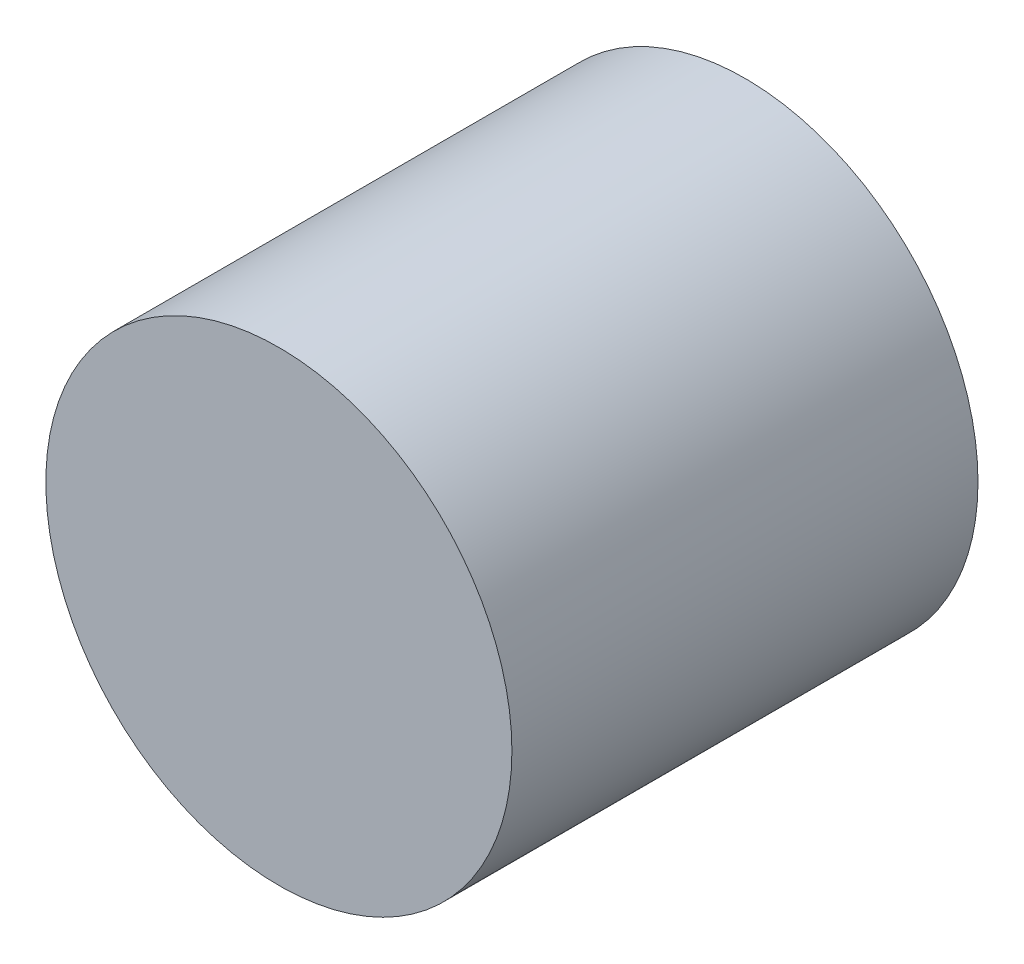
ISO-10303-21;
HEADER;
FILE_DESCRIPTION(('STEP AP214'),'2;1');
FILE_NAME('part.step','',(''),(''),'','','');
FILE_SCHEMA(('AUTOMOTIVE_DESIGN { 1 0 10303 214 1 1 1 1 }'));
ENDSEC;
DATA;
#1=APPLICATION_CONTEXT('core data for automotive mechanical design processes');
#2=APPLICATION_PROTOCOL_DEFINITION('international standard','automotive_design',2000,#1);
#3=PRODUCT_CONTEXT('',#1,'mechanical');
#4=PRODUCT('Part','Part','',(#3));
#5=PRODUCT_RELATED_PRODUCT_CATEGORY('part','',(#4));
#6=PRODUCT_DEFINITION_FORMATION('','',#4);
#7=PRODUCT_DEFINITION_CONTEXT('part definition',#1,'design');
#8=PRODUCT_DEFINITION('design','',#6,#7);
#9=PRODUCT_DEFINITION_SHAPE('','',#8);
#10=(LENGTH_UNIT() NAMED_UNIT(*) SI_UNIT(.MILLI.,.METRE.));
#11=(NAMED_UNIT(*) PLANE_ANGLE_UNIT() SI_UNIT($,.RADIAN.));
#12=(NAMED_UNIT(*) SI_UNIT($,.STERADIAN.) SOLID_ANGLE_UNIT());
#13=UNCERTAINTY_MEASURE_WITH_UNIT(LENGTH_MEASURE(1.E-05),#10,'distance_accuracy_value','');
#14=(GEOMETRIC_REPRESENTATION_CONTEXT(3) GLOBAL_UNCERTAINTY_ASSIGNED_CONTEXT((#13)) GLOBAL_UNIT_ASSIGNED_CONTEXT((#10,
#11,#12)) REPRESENTATION_CONTEXT('',''));
#15=CARTESIAN_POINT('',(0.,0.,0.));
#16=DIRECTION('',(0.,0.,1.));
#17=DIRECTION('',(1.,0.,0.));
#18=AXIS2_PLACEMENT_3D('',#15,#16,#17);
#19=CARTESIAN_POINT('',(0.,0.,30.));
#20=DIRECTION('',(0.,0.,1.));
#21=DIRECTION('',(1.,0.,0.));
#22=AXIS2_PLACEMENT_3D('',#19,#20,#21);
#23=CYLINDRICAL_SURFACE('',#22,5.);
#24=CARTESIAN_POINT('',(0.,0.,10.));
#25=DIRECTION('',(0.,0.,1.));
#26=DIRECTION('',(1.,0.,0.));
#27=AXIS2_PLACEMENT_3D('',#24,#25,#26);
#28=CIRCLE('',#27,5.);
#29=CARTESIAN_POINT('',(5.,0.,10.));
#30=VERTEX_POINT('',#29);
#31=EDGE_CURVE('E27',#30,#30,#28,.T.);
#32=ORIENTED_EDGE('',*,*,#31,.F.);
#33=EDGE_LOOP('',(#32));
#34=FACE_BOUND('',#33,.T.);
#35=CARTESIAN_POINT('',(0.,0.,0.));
#36=DIRECTION('',(0.,0.,1.));
#37=DIRECTION('',(1.,0.,0.));
#38=AXIS2_PLACEMENT_3D('',#35,#36,#37);
#39=CIRCLE('',#38,5.);
#40=CARTESIAN_POINT('',(5.,0.,0.));
#41=VERTEX_POINT('',#40);
#42=EDGE_CURVE('E8',#41,#41,#39,.T.);
#43=ORIENTED_EDGE('',*,*,#42,.T.);
#44=EDGE_LOOP('',(#43));
#45=FACE_BOUND('',#44,.T.);
#46=ADVANCED_FACE('F13',(#34,#45),#23,.T.);
#47=CARTESIAN_POINT('',(2.5,0.,0.));
#48=DIRECTION('',(0.,0.,1.));
#49=DIRECTION('',(1.,0.,0.));
#50=AXIS2_PLACEMENT_3D('',#47,#48,#49);
#51=PLANE('',#50);
#52=ORIENTED_EDGE('',*,*,#42,.F.);
#53=EDGE_LOOP('',(#52));
#54=FACE_BOUND('',#53,.T.);
#55=CARTESIAN_POINT('',(0.,0.,0.));
#56=DIRECTION('',(0.,0.,1.));
#57=DIRECTION('',(1.,0.,0.));
#58=AXIS2_PLACEMENT_3D('',#55,#56,#57);
#59=CIRCLE('',#58,2.5);
#60=CARTESIAN_POINT('',(2.5,0.,0.));
#61=VERTEX_POINT('',#60);
#62=EDGE_CURVE('E19',#61,#61,#59,.T.);
#63=ORIENTED_EDGE('',*,*,#62,.T.);
#64=EDGE_LOOP('',(#63));
#65=FACE_BOUND('',#64,.T.);
#66=ADVANCED_FACE('F36',(#54,#65),#51,.F.);
#67=CARTESIAN_POINT('',(0.,0.,30.));
#68=DIRECTION('',(0.,0.,1.));
#69=DIRECTION('',(1.,0.,0.));
#70=AXIS2_PLACEMENT_3D('',#67,#68,#69);
#71=CYLINDRICAL_SURFACE('',#70,2.5);
#72=ORIENTED_EDGE('',*,*,#62,.F.);
#73=EDGE_LOOP('',(#72));
#74=FACE_BOUND('',#73,.T.);
#75=CARTESIAN_POINT('',(0.,0.,5.));
#76=DIRECTION('',(0.,0.,1.));
#77=DIRECTION('',(1.,0.,0.));
#78=AXIS2_PLACEMENT_3D('',#75,#76,#77);
#79=CIRCLE('',#78,2.5);
#80=CARTESIAN_POINT('',(2.5,0.,5.));
#81=VERTEX_POINT('',#80);
#82=EDGE_CURVE('E23',#81,#81,#79,.T.);
#83=ORIENTED_EDGE('',*,*,#82,.T.);
#84=EDGE_LOOP('',(#83));
#85=FACE_BOUND('',#84,.T.);
#86=ADVANCED_FACE('F42',(#74,#85),#71,.F.);
#87=CARTESIAN_POINT('',(0.,0.,5.));
#88=DIRECTION('',(0.,0.,1.));
#89=DIRECTION('',(1.,0.,0.));
#90=AXIS2_PLACEMENT_3D('',#87,#88,#89);
#91=PLANE('',#90);
#92=ORIENTED_EDGE('',*,*,#82,.F.);
#93=EDGE_LOOP('',(#92));
#94=FACE_BOUND('',#93,.T.);
#95=ADVANCED_FACE('F48',(#94),#91,.F.);
#96=CARTESIAN_POINT('',(5.,0.,10.));
#97=DIRECTION('',(0.,0.,-1.));
#98=DIRECTION('',(-1.,0.,0.));
#99=AXIS2_PLACEMENT_3D('',#96,#97,#98);
#100=PLANE('',#99);
#101=ORIENTED_EDGE('',*,*,#31,.T.);
#102=EDGE_LOOP('',(#101));
#103=FACE_BOUND('',#102,.T.);
#104=ADVANCED_FACE('F33',(#103),#100,.F.);
#105=CLOSED_SHELL('',(#46,#66,#86,#95,#104));
#106=MANIFOLD_SOLID_BREP('B1',#105);
#107=ADVANCED_BREP_SHAPE_REPRESENTATION('',(#18,#106),#14);
#108=SHAPE_DEFINITION_REPRESENTATION(#9,#107);
ENDSEC;
END-ISO-10303-21;
